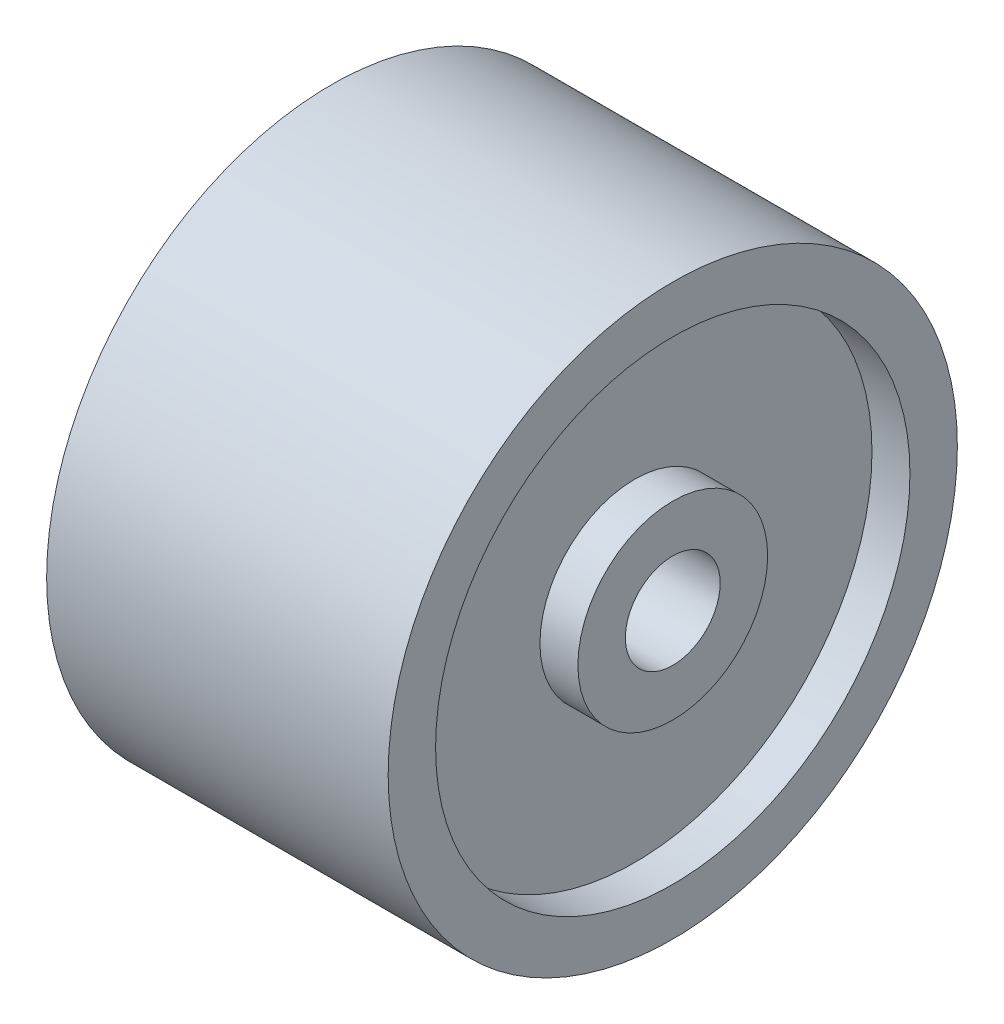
from build123d import *

# Parameters (mm, degrees)
SKETCH1_R      = 19.05
SKETCH1_R_2    = 3.175
EXTRUDE1_DEPTH = 11.43
SKETCH2_R      = 15.875
SKETCH2_R_2    = 6.35
EXTRUDE2_DEPTH = 2.54


with BuildPart() as part:
    # Sketch1 → Extrude1 (new, symmetric)
    with BuildSketch(Plane(origin=(0, 0, 0), x_dir=(0, 0, -1), z_dir=(1, 0, 0))):
        Circle(SKETCH1_R)
        Circle(SKETCH1_R_2, mode=Mode.SUBTRACT)
    extrude(amount=EXTRUDE1_DEPTH, both=True)

    # Sketch2 → Extrude2 (cut)
    with BuildSketch(Plane(origin=(11.43, 0, 0), x_dir=(0, 0, -1), z_dir=(1, 0, 0))):
        Circle(SKETCH2_R)
        Circle(SKETCH2_R_2, mode=Mode.SUBTRACT)
    extrude2 = extrude(amount=-EXTRUDE2_DEPTH, mode=Mode.SUBTRACT)

    # Mirror1: Extrude2 across plane
    add(extrude2.mirror(Plane(origin=(0, 0, 0), x_dir=(0, 0, 1), z_dir=(1, 0, 0))), mode=Mode.SUBTRACT)


solid = part.part
